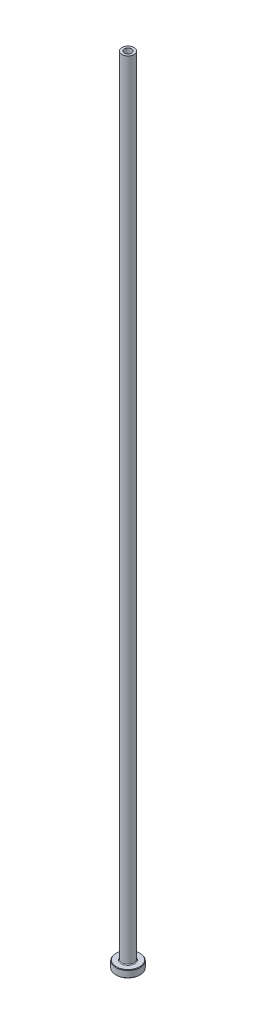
ISO-10303-21;
HEADER;
FILE_DESCRIPTION(('STEP AP214'),'2;1');
FILE_NAME('part.step','',(''),(''),'','','');
FILE_SCHEMA(('AUTOMOTIVE_DESIGN { 1 0 10303 214 1 1 1 1 }'));
ENDSEC;
DATA;
#1=APPLICATION_CONTEXT('core data for automotive mechanical design processes');
#2=APPLICATION_PROTOCOL_DEFINITION('international standard','automotive_design',2000,#1);
#3=PRODUCT_CONTEXT('',#1,'mechanical');
#4=PRODUCT('Part','Part','',(#3));
#5=PRODUCT_RELATED_PRODUCT_CATEGORY('part','',(#4));
#6=PRODUCT_DEFINITION_FORMATION('','',#4);
#7=PRODUCT_DEFINITION_CONTEXT('part definition',#1,'design');
#8=PRODUCT_DEFINITION('design','',#6,#7);
#9=PRODUCT_DEFINITION_SHAPE('','',#8);
#10=(LENGTH_UNIT() NAMED_UNIT(*) SI_UNIT(.MILLI.,.METRE.));
#11=(NAMED_UNIT(*) PLANE_ANGLE_UNIT() SI_UNIT($,.RADIAN.));
#12=(NAMED_UNIT(*) SI_UNIT($,.STERADIAN.) SOLID_ANGLE_UNIT());
#13=UNCERTAINTY_MEASURE_WITH_UNIT(LENGTH_MEASURE(1.E-05),#10,'distance_accuracy_value','');
#14=(GEOMETRIC_REPRESENTATION_CONTEXT(3) GLOBAL_UNCERTAINTY_ASSIGNED_CONTEXT((#13)) GLOBAL_UNIT_ASSIGNED_CONTEXT((#10,
#11,#12)) REPRESENTATION_CONTEXT('',''));
#15=CARTESIAN_POINT('',(0.,0.,0.));
#16=DIRECTION('',(0.,0.,1.));
#17=DIRECTION('',(1.,0.,0.));
#18=AXIS2_PLACEMENT_3D('',#15,#16,#17);
#19=CARTESIAN_POINT('',(0.,92.1876809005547,0.));
#20=DIRECTION('',(0.,1.,0.));
#21=DIRECTION('',(0.,0.,1.));
#22=AXIS2_PLACEMENT_3D('',#19,#20,#21);
#23=CYLINDRICAL_SURFACE('',#22,1.50000000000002);
#24=CARTESIAN_POINT('',(0.,325.,0.));
#25=DIRECTION('',(0.,1.,0.));
#26=DIRECTION('',(0.,0.,1.));
#27=AXIS2_PLACEMENT_3D('',#24,#25,#26);
#28=CIRCLE('',#27,1.50000000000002);
#29=CARTESIAN_POINT('',(0.,325.,1.50000000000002));
#30=VERTEX_POINT('',#29);
#31=EDGE_CURVE('E62',#30,#30,#28,.T.);
#32=ORIENTED_EDGE('',*,*,#31,.T.);
#33=EDGE_LOOP('',(#32));
#34=FACE_BOUND('',#33,.T.);
#35=CARTESIAN_POINT('',(0.,280.,0.));
#36=DIRECTION('',(0.,1.,0.));
#37=DIRECTION('',(0.,0.,1.));
#38=AXIS2_PLACEMENT_3D('',#35,#36,#37);
#39=CIRCLE('',#38,1.50000000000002);
#40=CARTESIAN_POINT('',(0.,280.,1.50000000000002));
#41=VERTEX_POINT('',#40);
#42=EDGE_CURVE('E71',#41,#41,#39,.T.);
#43=ORIENTED_EDGE('',*,*,#42,.F.);
#44=EDGE_LOOP('',(#43));
#45=FACE_BOUND('',#44,.T.);
#46=ADVANCED_FACE('F30',(#34,#45),#23,.F.);
#47=CARTESIAN_POINT('',(-1.50000000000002,325.,0.));
#48=DIRECTION('',(0.,1.,0.));
#49=DIRECTION('',(0.,0.,1.));
#50=AXIS2_PLACEMENT_3D('',#47,#48,#49);
#51=PLANE('',#50);
#52=CARTESIAN_POINT('',(0.,325.,0.));
#53=DIRECTION('',(0.,1.,0.));
#54=DIRECTION('',(0.,0.,1.));
#55=AXIS2_PLACEMENT_3D('',#52,#53,#54);
#56=CIRCLE('',#55,2.50000000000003);
#57=CARTESIAN_POINT('',(0.,325.,2.50000000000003));
#58=VERTEX_POINT('',#57);
#59=EDGE_CURVE('E65',#58,#58,#56,.T.);
#60=ORIENTED_EDGE('',*,*,#59,.T.);
#61=EDGE_LOOP('',(#60));
#62=FACE_BOUND('',#61,.T.);
#63=ORIENTED_EDGE('',*,*,#31,.F.);
#64=EDGE_LOOP('',(#63));
#65=FACE_BOUND('',#64,.T.);
#66=ADVANCED_FACE('F79',(#62,#65),#51,.T.);
#67=CARTESIAN_POINT('',(0.,92.1876809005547,0.));
#68=DIRECTION('',(0.,1.,0.));
#69=DIRECTION('',(0.,0.,1.));
#70=AXIS2_PLACEMENT_3D('',#67,#68,#69);
#71=CYLINDRICAL_SURFACE('',#70,2.50000000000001);
#72=CARTESIAN_POINT('',(0.,3.3,0.));
#73=DIRECTION('',(0.,1.,0.));
#74=DIRECTION('',(0.,0.,1.));
#75=AXIS2_PLACEMENT_3D('',#72,#73,#74);
#76=CIRCLE('',#75,2.50000000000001);
#77=CARTESIAN_POINT('',(0.,3.3,2.50000000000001));
#78=VERTEX_POINT('',#77);
#79=EDGE_CURVE('E59',#78,#78,#76,.T.);
#80=ORIENTED_EDGE('',*,*,#79,.T.);
#81=EDGE_LOOP('',(#80));
#82=FACE_BOUND('',#81,.T.);
#83=ORIENTED_EDGE('',*,*,#59,.F.);
#84=EDGE_LOOP('',(#83));
#85=FACE_BOUND('',#84,.T.);
#86=ADVANCED_FACE('F85',(#82,#85),#71,.T.);
#87=CARTESIAN_POINT('',(-2.49999999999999,3.,0.));
#88=DIRECTION('',(0.,1.,0.));
#89=DIRECTION('',(0.,0.,1.));
#90=AXIS2_PLACEMENT_3D('',#87,#88,#89);
#91=PLANE('',#90);
#92=CARTESIAN_POINT('',(0.,3.,0.));
#93=DIRECTION('',(0.,1.,0.));
#94=DIRECTION('',(0.,0.,1.));
#95=AXIS2_PLACEMENT_3D('',#92,#93,#94);
#96=CIRCLE('',#95,4.79999999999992);
#97=CARTESIAN_POINT('',(0.,3.,4.79999999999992));
#98=VERTEX_POINT('',#97);
#99=EDGE_CURVE('E53',#98,#98,#96,.T.);
#100=ORIENTED_EDGE('',*,*,#99,.T.);
#101=EDGE_LOOP('',(#100));
#102=FACE_BOUND('',#101,.T.);
#103=CARTESIAN_POINT('',(0.,3.,0.));
#104=DIRECTION('',(0.,1.,0.));
#105=DIRECTION('',(0.,0.,1.));
#106=AXIS2_PLACEMENT_3D('',#103,#104,#105);
#107=CIRCLE('',#106,2.80000000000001);
#108=CARTESIAN_POINT('',(0.,3.,2.80000000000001));
#109=VERTEX_POINT('',#108);
#110=EDGE_CURVE('E56',#109,#109,#107,.F.);
#111=ORIENTED_EDGE('',*,*,#110,.T.);
#112=EDGE_LOOP('',(#111));
#113=FACE_BOUND('',#112,.T.);
#114=ADVANCED_FACE('F111',(#102,#113),#91,.T.);
#115=CARTESIAN_POINT('',(0.,92.1876809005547,0.));
#116=DIRECTION('',(0.,1.,0.));
#117=DIRECTION('',(0.,0.,1.));
#118=AXIS2_PLACEMENT_3D('',#115,#116,#117);
#119=CYLINDRICAL_SURFACE('',#118,4.99999999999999);
#120=CARTESIAN_POINT('',(0.,2.79999999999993,0.));
#121=DIRECTION('',(0.,1.,0.));
#122=DIRECTION('',(0.,0.,1.));
#123=AXIS2_PLACEMENT_3D('',#120,#121,#122);
#124=CIRCLE('',#123,4.99999999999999);
#125=CARTESIAN_POINT('',(0.,2.79999999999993,4.99999999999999));
#126=VERTEX_POINT('',#125);
#127=EDGE_CURVE('E45',#126,#126,#124,.F.);
#128=ORIENTED_EDGE('',*,*,#127,.T.);
#129=EDGE_LOOP('',(#128));
#130=FACE_BOUND('',#129,.T.);
#131=CARTESIAN_POINT('',(0.,0.200000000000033,0.));
#132=DIRECTION('',(0.,-1.,0.));
#133=DIRECTION('',(0.,0.,-1.));
#134=AXIS2_PLACEMENT_3D('',#131,#132,#133);
#135=CIRCLE('',#134,4.99999999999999);
#136=CARTESIAN_POINT('',(0.,0.200000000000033,-4.99999999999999));
#137=VERTEX_POINT('',#136);
#138=EDGE_CURVE('E50',#137,#137,#135,.F.);
#139=ORIENTED_EDGE('',*,*,#138,.T.);
#140=EDGE_LOOP('',(#139));
#141=FACE_BOUND('',#140,.T.);
#142=ADVANCED_FACE('F108',(#130,#141),#119,.T.);
#143=CARTESIAN_POINT('',(-4.99999999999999,0.,0.));
#144=DIRECTION('',(0.,-1.,0.));
#145=DIRECTION('',(0.,0.,-1.));
#146=AXIS2_PLACEMENT_3D('',#143,#144,#145);
#147=PLANE('',#146);
#148=CARTESIAN_POINT('',(0.,0.,0.));
#149=DIRECTION('',(0.,-1.,0.));
#150=DIRECTION('',(0.,0.,-1.));
#151=AXIS2_PLACEMENT_3D('',#148,#149,#150);
#152=CIRCLE('',#151,2.25000000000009);
#153=CARTESIAN_POINT('',(0.,0.,-2.25000000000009));
#154=VERTEX_POINT('',#153);
#155=EDGE_CURVE('E37',#154,#154,#152,.F.);
#156=ORIENTED_EDGE('',*,*,#155,.T.);
#157=EDGE_LOOP('',(#156));
#158=FACE_BOUND('',#157,.T.);
#159=CARTESIAN_POINT('',(0.,0.,0.));
#160=DIRECTION('',(0.,-1.,0.));
#161=DIRECTION('',(0.,0.,-1.));
#162=AXIS2_PLACEMENT_3D('',#159,#160,#161);
#163=CIRCLE('',#162,4.79999999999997);
#164=CARTESIAN_POINT('',(0.,0.,-4.79999999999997));
#165=VERTEX_POINT('',#164);
#166=EDGE_CURVE('E41',#165,#165,#163,.T.);
#167=ORIENTED_EDGE('',*,*,#166,.T.);
#168=EDGE_LOOP('',(#167));
#169=FACE_BOUND('',#168,.T.);
#170=ADVANCED_FACE('F110',(#158,#169),#147,.T.);
#171=CARTESIAN_POINT('',(0.,92.1876809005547,0.));
#172=DIRECTION('',(0.,1.,0.));
#173=DIRECTION('',(0.,0.,1.));
#174=AXIS2_PLACEMENT_3D('',#171,#172,#173);
#175=CYLINDRICAL_SURFACE('',#174,1.75000000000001);
#176=CARTESIAN_POINT('',(0.,0.50000000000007,0.));
#177=DIRECTION('',(0.,-1.,0.));
#178=DIRECTION('',(0.,0.,-1.));
#179=AXIS2_PLACEMENT_3D('',#176,#177,#178);
#180=CIRCLE('',#179,1.75000000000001);
#181=CARTESIAN_POINT('',(0.,0.50000000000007,-1.75000000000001));
#182=VERTEX_POINT('',#181);
#183=EDGE_CURVE('E10',#182,#182,#180,.T.);
#184=ORIENTED_EDGE('',*,*,#183,.T.);
#185=EDGE_LOOP('',(#184));
#186=FACE_BOUND('',#185,.T.);
#187=CARTESIAN_POINT('',(0.,268.,0.));
#188=DIRECTION('',(0.,1.,0.));
#189=DIRECTION('',(0.,0.,1.));
#190=AXIS2_PLACEMENT_3D('',#187,#188,#189);
#191=CIRCLE('',#190,1.75000000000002);
#192=CARTESIAN_POINT('',(0.,268.,1.75000000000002));
#193=VERTEX_POINT('',#192);
#194=EDGE_CURVE('E68',#193,#193,#191,.T.);
#195=ORIENTED_EDGE('',*,*,#194,.T.);
#196=EDGE_LOOP('',(#195));
#197=FACE_BOUND('',#196,.T.);
#198=ADVANCED_FACE('F118',(#186,#197),#175,.F.);
#199=CARTESIAN_POINT('',(0.,268.,0.));
#200=DIRECTION('',(0.,-1.,0.));
#201=DIRECTION('',(0.,0.,-1.));
#202=AXIS2_PLACEMENT_3D('',#199,#200,#201);
#203=CONICAL_SURFACE('',#202,1.75000000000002,0.0208303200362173);
#204=ORIENTED_EDGE('',*,*,#42,.T.);
#205=EDGE_LOOP('',(#204));
#206=FACE_BOUND('',#205,.T.);
#207=ORIENTED_EDGE('',*,*,#194,.F.);
#208=EDGE_LOOP('',(#207));
#209=FACE_BOUND('',#208,.T.);
#210=ADVANCED_FACE('F75',(#206,#209),#203,.F.);
#211=CARTESIAN_POINT('',(0.,3.3,0.));
#212=DIRECTION('',(0.,1.,0.));
#213=DIRECTION('',(0.,0.,1.));
#214=AXIS2_PLACEMENT_3D('',#211,#212,#213);
#215=TOROIDAL_SURFACE('',#214,2.80000000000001,0.3);
#216=ORIENTED_EDGE('',*,*,#110,.F.);
#217=EDGE_LOOP('',(#216));
#218=FACE_BOUND('',#217,.T.);
#219=ORIENTED_EDGE('',*,*,#79,.F.);
#220=EDGE_LOOP('',(#219));
#221=FACE_BOUND('',#220,.T.);
#222=ADVANCED_FACE('F90',(#218,#221),#215,.F.);
#223=CARTESIAN_POINT('',(0.,3.,0.));
#224=DIRECTION('',(0.,-1.,0.));
#225=DIRECTION('',(0.,0.,-1.));
#226=AXIS2_PLACEMENT_3D('',#223,#224,#225);
#227=CONICAL_SURFACE('',#226,4.79999999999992,0.785398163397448);
#228=ORIENTED_EDGE('',*,*,#127,.F.);
#229=EDGE_LOOP('',(#228));
#230=FACE_BOUND('',#229,.T.);
#231=ORIENTED_EDGE('',*,*,#99,.F.);
#232=EDGE_LOOP('',(#231));
#233=FACE_BOUND('',#232,.T.);
#234=ADVANCED_FACE('F93',(#230,#233),#227,.T.);
#235=CARTESIAN_POINT('',(0.,0.200000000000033,0.));
#236=DIRECTION('',(0.,1.,0.));
#237=DIRECTION('',(0.,0.,1.));
#238=AXIS2_PLACEMENT_3D('',#235,#236,#237);
#239=CONICAL_SURFACE('',#238,4.99999999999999,0.785398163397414);
#240=ORIENTED_EDGE('',*,*,#166,.F.);
#241=EDGE_LOOP('',(#240));
#242=FACE_BOUND('',#241,.T.);
#243=ORIENTED_EDGE('',*,*,#138,.F.);
#244=EDGE_LOOP('',(#243));
#245=FACE_BOUND('',#244,.T.);
#246=ADVANCED_FACE('F96',(#242,#245),#239,.T.);
#247=CARTESIAN_POINT('',(0.,0.,0.));
#248=DIRECTION('',(0.,-1.,0.));
#249=DIRECTION('',(0.,0.,-1.));
#250=AXIS2_PLACEMENT_3D('',#247,#248,#249);
#251=CONICAL_SURFACE('',#250,2.25000000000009,0.785398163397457);
#252=ORIENTED_EDGE('',*,*,#183,.F.);
#253=EDGE_LOOP('',(#252));
#254=FACE_BOUND('',#253,.T.);
#255=ORIENTED_EDGE('',*,*,#155,.F.);
#256=EDGE_LOOP('',(#255));
#257=FACE_BOUND('',#256,.T.);
#258=ADVANCED_FACE('F32',(#254,#257),#251,.F.);
#259=CLOSED_SHELL('',(#46,#66,#86,#114,#142,#170,#198,#210,#222,#234,#246,#258));
#260=MANIFOLD_SOLID_BREP('B2',#259);
#261=ADVANCED_BREP_SHAPE_REPRESENTATION('',(#18,#260),#14);
#262=SHAPE_DEFINITION_REPRESENTATION(#9,#261);
ENDSEC;
END-ISO-10303-21;
